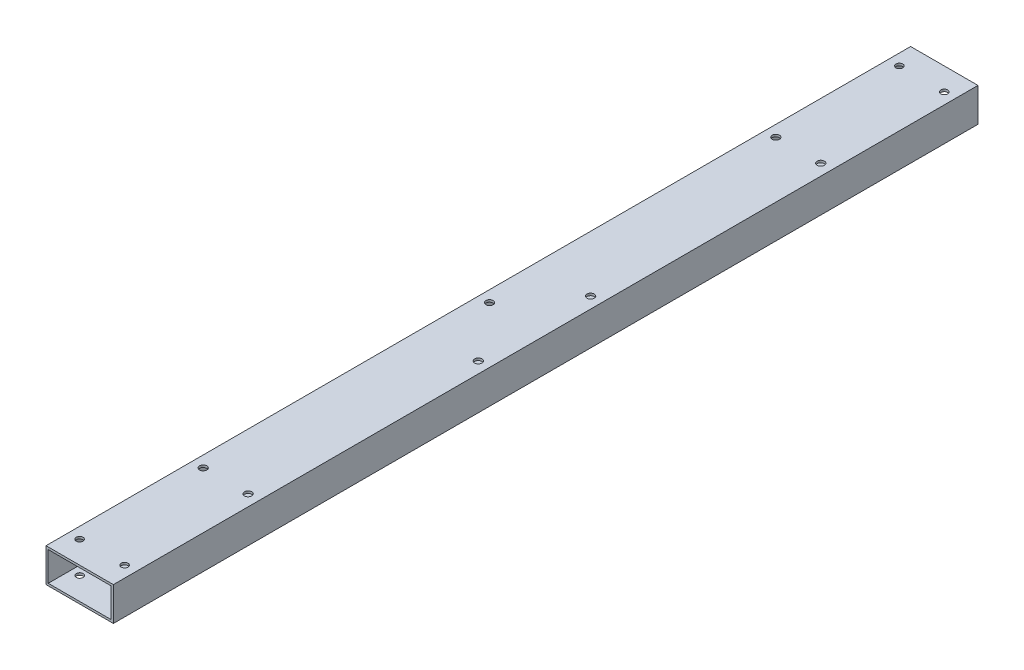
ISO-10303-21;
HEADER;
FILE_DESCRIPTION(('STEP AP214'),'2;1');
FILE_NAME('part.step','',(''),(''),'','','');
FILE_SCHEMA(('AUTOMOTIVE_DESIGN { 1 0 10303 214 1 1 1 1 }'));
ENDSEC;
DATA;
#1=APPLICATION_CONTEXT('core data for automotive mechanical design processes');
#2=APPLICATION_PROTOCOL_DEFINITION('international standard','automotive_design',2000,#1);
#3=PRODUCT_CONTEXT('',#1,'mechanical');
#4=PRODUCT('Part','Part','',(#3));
#5=PRODUCT_RELATED_PRODUCT_CATEGORY('part','',(#4));
#6=PRODUCT_DEFINITION_FORMATION('','',#4);
#7=PRODUCT_DEFINITION_CONTEXT('part definition',#1,'design');
#8=PRODUCT_DEFINITION('design','',#6,#7);
#9=PRODUCT_DEFINITION_SHAPE('','',#8);
#10=(LENGTH_UNIT() NAMED_UNIT(*) SI_UNIT(.MILLI.,.METRE.));
#11=(NAMED_UNIT(*) PLANE_ANGLE_UNIT() SI_UNIT($,.RADIAN.));
#12=(NAMED_UNIT(*) SI_UNIT($,.STERADIAN.) SOLID_ANGLE_UNIT());
#13=UNCERTAINTY_MEASURE_WITH_UNIT(LENGTH_MEASURE(1.E-05),#10,'distance_accuracy_value','');
#14=(GEOMETRIC_REPRESENTATION_CONTEXT(3) GLOBAL_UNCERTAINTY_ASSIGNED_CONTEXT((#13)) GLOBAL_UNIT_ASSIGNED_CONTEXT((#10,
#11,#12)) REPRESENTATION_CONTEXT('',''));
#15=CARTESIAN_POINT('',(0.,0.,0.));
#16=DIRECTION('',(0.,0.,1.));
#17=DIRECTION('',(1.,0.,0.));
#18=AXIS2_PLACEMENT_3D('',#15,#16,#17);
#19=CARTESIAN_POINT('',(0.,0.,385.));
#20=DIRECTION('',(0.,0.,1.));
#21=DIRECTION('',(1.,0.,0.));
#22=AXIS2_PLACEMENT_3D('',#19,#20,#21);
#23=PLANE('',#22);
#24=DIRECTION('',(0.,-1.,0.));
#25=VECTOR('',#24,1.);
#26=CARTESIAN_POINT('',(-30.,15.,385.));
#27=LINE('',#26,#25);
#28=CARTESIAN_POINT('',(-30.,15.,385.));
#29=VERTEX_POINT('',#28);
#30=CARTESIAN_POINT('',(-30.,-15.,385.));
#31=VERTEX_POINT('',#30);
#32=EDGE_CURVE('E197',#29,#31,#27,.T.);
#33=ORIENTED_EDGE('',*,*,#32,.T.);
#34=DIRECTION('',(1.,0.,0.));
#35=VECTOR('',#34,1.);
#36=CARTESIAN_POINT('',(-30.,-15.,385.));
#37=LINE('',#36,#35);
#38=CARTESIAN_POINT('',(30.,-15.,385.));
#39=VERTEX_POINT('',#38);
#40=EDGE_CURVE('E201',#31,#39,#37,.T.);
#41=ORIENTED_EDGE('',*,*,#40,.T.);
#42=DIRECTION('',(0.,1.,0.));
#43=VECTOR('',#42,1.);
#44=CARTESIAN_POINT('',(30.,15.,385.));
#45=LINE('',#44,#43);
#46=CARTESIAN_POINT('',(30.,15.,385.));
#47=VERTEX_POINT('',#46);
#48=EDGE_CURVE('E205',#39,#47,#45,.T.);
#49=ORIENTED_EDGE('',*,*,#48,.T.);
#50=DIRECTION('',(-1.,0.,0.));
#51=VECTOR('',#50,1.);
#52=CARTESIAN_POINT('',(-30.,15.,385.));
#53=LINE('',#52,#51);
#54=EDGE_CURVE('E208',#47,#29,#53,.T.);
#55=ORIENTED_EDGE('',*,*,#54,.T.);
#56=EDGE_LOOP('',(#33,#41,#49,#55));
#57=FACE_BOUND('',#56,.T.);
#58=DIRECTION('',(1.,0.,0.));
#59=VECTOR('',#58,1.);
#60=CARTESIAN_POINT('',(-28.,-13.,385.));
#61=LINE('',#60,#59);
#62=CARTESIAN_POINT('',(-28.,-13.,385.));
#63=VERTEX_POINT('',#62);
#64=CARTESIAN_POINT('',(28.,-13.,385.));
#65=VERTEX_POINT('',#64);
#66=EDGE_CURVE('E142',#63,#65,#61,.T.);
#67=ORIENTED_EDGE('',*,*,#66,.F.);
#68=DIRECTION('',(0.,-1.,0.));
#69=VECTOR('',#68,1.);
#70=CARTESIAN_POINT('',(-28.,13.,385.));
#71=LINE('',#70,#69);
#72=CARTESIAN_POINT('',(-28.,13.,385.));
#73=VERTEX_POINT('',#72);
#74=EDGE_CURVE('E132',#73,#63,#71,.T.);
#75=ORIENTED_EDGE('',*,*,#74,.F.);
#76=DIRECTION('',(-1.,0.,0.));
#77=VECTOR('',#76,1.);
#78=CARTESIAN_POINT('',(-28.,13.,385.));
#79=LINE('',#78,#77);
#80=CARTESIAN_POINT('',(28.,13.,385.));
#81=VERTEX_POINT('',#80);
#82=EDGE_CURVE('E162',#81,#73,#79,.T.);
#83=ORIENTED_EDGE('',*,*,#82,.F.);
#84=DIRECTION('',(0.,1.,0.));
#85=VECTOR('',#84,1.);
#86=CARTESIAN_POINT('',(28.,13.,385.));
#87=LINE('',#86,#85);
#88=EDGE_CURVE('E158',#65,#81,#87,.T.);
#89=ORIENTED_EDGE('',*,*,#88,.F.);
#90=EDGE_LOOP('',(#67,#75,#83,#89));
#91=FACE_BOUND('',#90,.T.);
#92=ADVANCED_FACE('F44',(#57,#91),#23,.T.);
#93=CARTESIAN_POINT('',(0.,0.,-385.));
#94=DIRECTION('',(0.,0.,1.));
#95=DIRECTION('',(1.,0.,0.));
#96=AXIS2_PLACEMENT_3D('',#93,#94,#95);
#97=PLANE('',#96);
#98=DIRECTION('',(0.,-1.,0.));
#99=VECTOR('',#98,1.);
#100=CARTESIAN_POINT('',(-30.,15.,-385.));
#101=LINE('',#100,#99);
#102=CARTESIAN_POINT('',(-30.,15.,-385.));
#103=VERTEX_POINT('',#102);
#104=CARTESIAN_POINT('',(-30.,-15.,-385.));
#105=VERTEX_POINT('',#104);
#106=EDGE_CURVE('E152',#103,#105,#101,.T.);
#107=ORIENTED_EDGE('',*,*,#106,.F.);
#108=DIRECTION('',(-1.,0.,0.));
#109=VECTOR('',#108,1.);
#110=CARTESIAN_POINT('',(-30.,15.,-385.));
#111=LINE('',#110,#109);
#112=CARTESIAN_POINT('',(30.,15.,-385.));
#113=VERTEX_POINT('',#112);
#114=EDGE_CURVE('E202',#113,#103,#111,.T.);
#115=ORIENTED_EDGE('',*,*,#114,.F.);
#116=DIRECTION('',(0.,1.,0.));
#117=VECTOR('',#116,1.);
#118=CARTESIAN_POINT('',(30.,15.,-385.));
#119=LINE('',#118,#117);
#120=CARTESIAN_POINT('',(30.,-15.,-385.));
#121=VERTEX_POINT('',#120);
#122=EDGE_CURVE('E218',#121,#113,#119,.T.);
#123=ORIENTED_EDGE('',*,*,#122,.F.);
#124=DIRECTION('',(1.,0.,0.));
#125=VECTOR('',#124,1.);
#126=CARTESIAN_POINT('',(-30.,-15.,-385.));
#127=LINE('',#126,#125);
#128=EDGE_CURVE('E215',#105,#121,#127,.T.);
#129=ORIENTED_EDGE('',*,*,#128,.F.);
#130=EDGE_LOOP('',(#107,#115,#123,#129));
#131=FACE_BOUND('',#130,.T.);
#132=DIRECTION('',(0.,-1.,0.));
#133=VECTOR('',#132,1.);
#134=CARTESIAN_POINT('',(-28.,13.,-385.));
#135=LINE('',#134,#133);
#136=CARTESIAN_POINT('',(-28.,13.,-385.));
#137=VERTEX_POINT('',#136);
#138=CARTESIAN_POINT('',(-28.,-13.,-385.));
#139=VERTEX_POINT('',#138);
#140=EDGE_CURVE('E168',#137,#139,#135,.T.);
#141=ORIENTED_EDGE('',*,*,#140,.T.);
#142=DIRECTION('',(1.,0.,0.));
#143=VECTOR('',#142,1.);
#144=CARTESIAN_POINT('',(-28.,-13.,-385.));
#145=LINE('',#144,#143);
#146=CARTESIAN_POINT('',(28.,-13.,-385.));
#147=VERTEX_POINT('',#146);
#148=EDGE_CURVE('E172',#139,#147,#145,.T.);
#149=ORIENTED_EDGE('',*,*,#148,.T.);
#150=DIRECTION('',(0.,1.,0.));
#151=VECTOR('',#150,1.);
#152=CARTESIAN_POINT('',(28.,13.,-385.));
#153=LINE('',#152,#151);
#154=CARTESIAN_POINT('',(28.,13.,-385.));
#155=VERTEX_POINT('',#154);
#156=EDGE_CURVE('E177',#147,#155,#153,.T.);
#157=ORIENTED_EDGE('',*,*,#156,.T.);
#158=DIRECTION('',(-1.,0.,0.));
#159=VECTOR('',#158,1.);
#160=CARTESIAN_POINT('',(-28.,13.,-385.));
#161=LINE('',#160,#159);
#162=EDGE_CURVE('E143',#155,#137,#161,.T.);
#163=ORIENTED_EDGE('',*,*,#162,.T.);
#164=EDGE_LOOP('',(#141,#149,#157,#163));
#165=FACE_BOUND('',#164,.T.);
#166=ADVANCED_FACE('F390',(#131,#165),#97,.F.);
#167=CARTESIAN_POINT('',(-30.,15.,385.));
#168=DIRECTION('',(1.,0.,0.));
#169=DIRECTION('',(0.,0.,-1.));
#170=AXIS2_PLACEMENT_3D('',#167,#168,#169);
#171=PLANE('',#170);
#172=ORIENTED_EDGE('',*,*,#106,.T.);
#173=DIRECTION('',(0.,0.,-1.));
#174=VECTOR('',#173,1.);
#175=CARTESIAN_POINT('',(-30.,-15.,385.));
#176=LINE('',#175,#174);
#177=EDGE_CURVE('E11',#31,#105,#176,.T.);
#178=ORIENTED_EDGE('',*,*,#177,.F.);
#179=ORIENTED_EDGE('',*,*,#32,.F.);
#180=DIRECTION('',(0.,0.,-1.));
#181=VECTOR('',#180,1.);
#182=CARTESIAN_POINT('',(-30.,15.,385.));
#183=LINE('',#182,#181);
#184=EDGE_CURVE('E211',#29,#103,#183,.T.);
#185=ORIENTED_EDGE('',*,*,#184,.T.);
#186=EDGE_LOOP('',(#172,#178,#179,#185));
#187=FACE_BOUND('',#186,.T.);
#188=ADVANCED_FACE('F46',(#187),#171,.F.);
#189=CARTESIAN_POINT('',(-30.,-15.,385.));
#190=DIRECTION('',(0.,1.,0.));
#191=DIRECTION('',(0.,0.,1.));
#192=AXIS2_PLACEMENT_3D('',#189,#190,#191);
#193=PLANE('',#192);
#194=CARTESIAN_POINT('',(20.0000000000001,-15.,50.));
#195=DIRECTION('',(0.,-1.,0.));
#196=DIRECTION('',(0.,0.,-1.));
#197=AXIS2_PLACEMENT_3D('',#194,#195,#196);
#198=CIRCLE('',#197,8.);
#199=CARTESIAN_POINT('',(20.0000000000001,-15.,42.));
#200=VERTEX_POINT('',#199);
#201=EDGE_CURVE('E418',#200,#200,#198,.T.);
#202=ORIENTED_EDGE('',*,*,#201,.F.);
#203=EDGE_LOOP('',(#202));
#204=FACE_BOUND('',#203,.T.);
#205=CARTESIAN_POINT('',(-20.,-15.,255.));
#206=DIRECTION('',(0.,-1.,0.));
#207=DIRECTION('',(0.,0.,-1.));
#208=AXIS2_PLACEMENT_3D('',#205,#206,#207);
#209=CIRCLE('',#208,8.00000000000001);
#210=CARTESIAN_POINT('',(-20.,-15.,247.));
#211=VERTEX_POINT('',#210);
#212=EDGE_CURVE('E422',#211,#211,#209,.T.);
#213=ORIENTED_EDGE('',*,*,#212,.F.);
#214=EDGE_LOOP('',(#213));
#215=FACE_BOUND('',#214,.T.);
#216=CARTESIAN_POINT('',(20.,-15.,255.));
#217=DIRECTION('',(0.,-1.,0.));
#218=DIRECTION('',(0.,0.,-1.));
#219=AXIS2_PLACEMENT_3D('',#216,#217,#218);
#220=CIRCLE('',#219,8.);
#221=CARTESIAN_POINT('',(20.,-15.,247.));
#222=VERTEX_POINT('',#221);
#223=EDGE_CURVE('E426',#222,#222,#220,.T.);
#224=ORIENTED_EDGE('',*,*,#223,.F.);
#225=EDGE_LOOP('',(#224));
#226=FACE_BOUND('',#225,.T.);
#227=CARTESIAN_POINT('',(20.,-15.,365.));
#228=DIRECTION('',(0.,-1.,0.));
#229=DIRECTION('',(0.,0.,-1.));
#230=AXIS2_PLACEMENT_3D('',#227,#228,#229);
#231=CIRCLE('',#230,3.05000000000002);
#232=CARTESIAN_POINT('',(20.,-15.,361.95));
#233=VERTEX_POINT('',#232);
#234=EDGE_CURVE('E430',#233,#233,#231,.T.);
#235=ORIENTED_EDGE('',*,*,#234,.F.);
#236=EDGE_LOOP('',(#235));
#237=FACE_BOUND('',#236,.T.);
#238=CARTESIAN_POINT('',(-20.,-15.,365.));
#239=DIRECTION('',(0.,-1.,0.));
#240=DIRECTION('',(0.,0.,-1.));
#241=AXIS2_PLACEMENT_3D('',#238,#239,#240);
#242=CIRCLE('',#241,3.05000000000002);
#243=CARTESIAN_POINT('',(-20.,-15.,361.95));
#244=VERTEX_POINT('',#243);
#245=EDGE_CURVE('E270',#244,#244,#242,.T.);
#246=ORIENTED_EDGE('',*,*,#245,.F.);
#247=EDGE_LOOP('',(#246));
#248=FACE_BOUND('',#247,.T.);
#249=CARTESIAN_POINT('',(-20.,-15.,0.));
#250=DIRECTION('',(0.,1.,0.));
#251=DIRECTION('',(0.,0.,1.));
#252=AXIS2_PLACEMENT_3D('',#249,#250,#251);
#253=CIRCLE('',#252,8.);
#254=CARTESIAN_POINT('',(-20.,-15.,8.));
#255=VERTEX_POINT('',#254);
#256=EDGE_CURVE('E305',#255,#255,#253,.T.);
#257=ORIENTED_EDGE('',*,*,#256,.T.);
#258=EDGE_LOOP('',(#257));
#259=FACE_BOUND('',#258,.T.);
#260=CARTESIAN_POINT('',(20.0000000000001,-15.,-50.));
#261=DIRECTION('',(0.,1.,0.));
#262=DIRECTION('',(0.,0.,1.));
#263=AXIS2_PLACEMENT_3D('',#260,#261,#262);
#264=CIRCLE('',#263,8.);
#265=CARTESIAN_POINT('',(20.0000000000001,-15.,-42.));
#266=VERTEX_POINT('',#265);
#267=EDGE_CURVE('E311',#266,#266,#264,.T.);
#268=ORIENTED_EDGE('',*,*,#267,.T.);
#269=EDGE_LOOP('',(#268));
#270=FACE_BOUND('',#269,.T.);
#271=CARTESIAN_POINT('',(-20.,-15.,-255.));
#272=DIRECTION('',(0.,1.,0.));
#273=DIRECTION('',(0.,0.,1.));
#274=AXIS2_PLACEMENT_3D('',#271,#272,#273);
#275=CIRCLE('',#274,8.00000000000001);
#276=CARTESIAN_POINT('',(-20.,-15.,-247.));
#277=VERTEX_POINT('',#276);
#278=EDGE_CURVE('E306',#277,#277,#275,.T.);
#279=ORIENTED_EDGE('',*,*,#278,.T.);
#280=EDGE_LOOP('',(#279));
#281=FACE_BOUND('',#280,.T.);
#282=CARTESIAN_POINT('',(20.,-15.,-255.));
#283=DIRECTION('',(0.,1.,0.));
#284=DIRECTION('',(0.,0.,1.));
#285=AXIS2_PLACEMENT_3D('',#282,#283,#284);
#286=CIRCLE('',#285,8.);
#287=CARTESIAN_POINT('',(20.,-15.,-247.));
#288=VERTEX_POINT('',#287);
#289=EDGE_CURVE('E310',#288,#288,#286,.T.);
#290=ORIENTED_EDGE('',*,*,#289,.T.);
#291=EDGE_LOOP('',(#290));
#292=FACE_BOUND('',#291,.T.);
#293=CARTESIAN_POINT('',(20.,-15.,-365.));
#294=DIRECTION('',(0.,1.,0.));
#295=DIRECTION('',(0.,0.,1.));
#296=AXIS2_PLACEMENT_3D('',#293,#294,#295);
#297=CIRCLE('',#296,3.05000000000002);
#298=CARTESIAN_POINT('',(20.,-15.,-361.95));
#299=VERTEX_POINT('',#298);
#300=EDGE_CURVE('E337',#299,#299,#297,.T.);
#301=ORIENTED_EDGE('',*,*,#300,.T.);
#302=EDGE_LOOP('',(#301));
#303=FACE_BOUND('',#302,.T.);
#304=CARTESIAN_POINT('',(-20.,-15.,-365.));
#305=DIRECTION('',(0.,1.,0.));
#306=DIRECTION('',(0.,0.,1.));
#307=AXIS2_PLACEMENT_3D('',#304,#305,#306);
#308=CIRCLE('',#307,3.05000000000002);
#309=CARTESIAN_POINT('',(-20.,-15.,-361.95));
#310=VERTEX_POINT('',#309);
#311=EDGE_CURVE('E238',#310,#310,#308,.T.);
#312=ORIENTED_EDGE('',*,*,#311,.T.);
#313=EDGE_LOOP('',(#312));
#314=FACE_BOUND('',#313,.T.);
#315=ORIENTED_EDGE('',*,*,#128,.T.);
#316=DIRECTION('',(0.,0.,-1.));
#317=VECTOR('',#316,1.);
#318=CARTESIAN_POINT('',(30.,-15.,385.));
#319=LINE('',#318,#317);
#320=EDGE_CURVE('E54',#39,#121,#319,.T.);
#321=ORIENTED_EDGE('',*,*,#320,.F.);
#322=ORIENTED_EDGE('',*,*,#40,.F.);
#323=ORIENTED_EDGE('',*,*,#177,.T.);
#324=EDGE_LOOP('',(#315,#321,#322,#323));
#325=FACE_BOUND('',#324,.T.);
#326=ADVANCED_FACE('F406',(#204,#215,#226,#237,#248,#259,#270,#281,#292,#303,#314,#325),#193,.F.);
#327=CARTESIAN_POINT('',(30.,15.,385.));
#328=DIRECTION('',(-1.,0.,0.));
#329=DIRECTION('',(0.,0.,1.));
#330=AXIS2_PLACEMENT_3D('',#327,#328,#329);
#331=PLANE('',#330);
#332=ORIENTED_EDGE('',*,*,#122,.T.);
#333=DIRECTION('',(0.,0.,-1.));
#334=VECTOR('',#333,1.);
#335=CARTESIAN_POINT('',(30.,15.,385.));
#336=LINE('',#335,#334);
#337=EDGE_CURVE('E226',#47,#113,#336,.T.);
#338=ORIENTED_EDGE('',*,*,#337,.F.);
#339=ORIENTED_EDGE('',*,*,#48,.F.);
#340=ORIENTED_EDGE('',*,*,#320,.T.);
#341=EDGE_LOOP('',(#332,#338,#339,#340));
#342=FACE_BOUND('',#341,.T.);
#343=ADVANCED_FACE('F403',(#342),#331,.F.);
#344=CARTESIAN_POINT('',(-30.,15.,385.));
#345=DIRECTION('',(0.,-1.,0.));
#346=DIRECTION('',(0.,0.,-1.));
#347=AXIS2_PLACEMENT_3D('',#344,#345,#346);
#348=PLANE('',#347);
#349=CARTESIAN_POINT('',(20.,15.,255.));
#350=DIRECTION('',(0.,-1.,0.));
#351=DIRECTION('',(0.,0.,-1.));
#352=AXIS2_PLACEMENT_3D('',#349,#350,#351);
#353=CIRCLE('',#352,3.25);
#354=CARTESIAN_POINT('',(20.,15.,251.75));
#355=VERTEX_POINT('',#354);
#356=EDGE_CURVE('E301',#355,#355,#353,.F.);
#357=ORIENTED_EDGE('',*,*,#356,.F.);
#358=EDGE_LOOP('',(#357));
#359=FACE_BOUND('',#358,.T.);
#360=CARTESIAN_POINT('',(-20.,15.,255.));
#361=DIRECTION('',(0.,-1.,0.));
#362=DIRECTION('',(0.,0.,-1.));
#363=AXIS2_PLACEMENT_3D('',#360,#361,#362);
#364=CIRCLE('',#363,3.25);
#365=CARTESIAN_POINT('',(-20.,15.,251.75));
#366=VERTEX_POINT('',#365);
#367=EDGE_CURVE('E284',#366,#366,#364,.F.);
#368=ORIENTED_EDGE('',*,*,#367,.F.);
#369=EDGE_LOOP('',(#368));
#370=FACE_BOUND('',#369,.T.);
#371=CARTESIAN_POINT('',(20.,15.,365.));
#372=DIRECTION('',(0.,-1.,0.));
#373=DIRECTION('',(0.,0.,-1.));
#374=AXIS2_PLACEMENT_3D('',#371,#372,#373);
#375=CIRCLE('',#374,3.05000000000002);
#376=CARTESIAN_POINT('',(20.,15.,361.95));
#377=VERTEX_POINT('',#376);
#378=EDGE_CURVE('E285',#377,#377,#375,.F.);
#379=ORIENTED_EDGE('',*,*,#378,.F.);
#380=EDGE_LOOP('',(#379));
#381=FACE_BOUND('',#380,.T.);
#382=CARTESIAN_POINT('',(20.0000000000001,15.,50.));
#383=DIRECTION('',(0.,-1.,0.));
#384=DIRECTION('',(0.,0.,-1.));
#385=AXIS2_PLACEMENT_3D('',#382,#383,#384);
#386=CIRCLE('',#385,3.25);
#387=CARTESIAN_POINT('',(20.0000000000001,15.,46.75));
#388=VERTEX_POINT('',#387);
#389=EDGE_CURVE('E275',#388,#388,#386,.F.);
#390=ORIENTED_EDGE('',*,*,#389,.F.);
#391=EDGE_LOOP('',(#390));
#392=FACE_BOUND('',#391,.T.);
#393=CARTESIAN_POINT('',(-20.,15.,365.));
#394=DIRECTION('',(0.,-1.,0.));
#395=DIRECTION('',(0.,0.,-1.));
#396=AXIS2_PLACEMENT_3D('',#393,#394,#395);
#397=CIRCLE('',#396,3.05000000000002);
#398=CARTESIAN_POINT('',(-20.,15.,361.95));
#399=VERTEX_POINT('',#398);
#400=EDGE_CURVE('E276',#399,#399,#397,.F.);
#401=ORIENTED_EDGE('',*,*,#400,.F.);
#402=EDGE_LOOP('',(#401));
#403=FACE_BOUND('',#402,.T.);
#404=CARTESIAN_POINT('',(-20.,15.,0.));
#405=DIRECTION('',(0.,-1.,0.));
#406=DIRECTION('',(0.,0.,-1.));
#407=AXIS2_PLACEMENT_3D('',#404,#405,#406);
#408=CIRCLE('',#407,3.25);
#409=CARTESIAN_POINT('',(-20.,15.,-3.25));
#410=VERTEX_POINT('',#409);
#411=EDGE_CURVE('E173',#410,#410,#408,.T.);
#412=ORIENTED_EDGE('',*,*,#411,.T.);
#413=EDGE_LOOP('',(#412));
#414=FACE_BOUND('',#413,.T.);
#415=CARTESIAN_POINT('',(20.,15.,-255.));
#416=DIRECTION('',(0.,-1.,0.));
#417=DIRECTION('',(0.,0.,-1.));
#418=AXIS2_PLACEMENT_3D('',#415,#416,#417);
#419=CIRCLE('',#418,3.25);
#420=CARTESIAN_POINT('',(20.,15.,-258.25));
#421=VERTEX_POINT('',#420);
#422=EDGE_CURVE('E260',#421,#421,#419,.T.);
#423=ORIENTED_EDGE('',*,*,#422,.T.);
#424=EDGE_LOOP('',(#423));
#425=FACE_BOUND('',#424,.T.);
#426=CARTESIAN_POINT('',(-20.,15.,-255.));
#427=DIRECTION('',(0.,-1.,0.));
#428=DIRECTION('',(0.,0.,-1.));
#429=AXIS2_PLACEMENT_3D('',#426,#427,#428);
#430=CIRCLE('',#429,3.25);
#431=CARTESIAN_POINT('',(-20.,15.,-258.25));
#432=VERTEX_POINT('',#431);
#433=EDGE_CURVE('E254',#432,#432,#430,.T.);
#434=ORIENTED_EDGE('',*,*,#433,.T.);
#435=EDGE_LOOP('',(#434));
#436=FACE_BOUND('',#435,.T.);
#437=CARTESIAN_POINT('',(20.,15.,-365.));
#438=DIRECTION('',(0.,-1.,0.));
#439=DIRECTION('',(0.,0.,-1.));
#440=AXIS2_PLACEMENT_3D('',#437,#438,#439);
#441=CIRCLE('',#440,3.05000000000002);
#442=CARTESIAN_POINT('',(20.,15.,-368.05));
#443=VERTEX_POINT('',#442);
#444=EDGE_CURVE('E255',#443,#443,#441,.T.);
#445=ORIENTED_EDGE('',*,*,#444,.T.);
#446=EDGE_LOOP('',(#445));
#447=FACE_BOUND('',#446,.T.);
#448=CARTESIAN_POINT('',(20.0000000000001,15.,-50.));
#449=DIRECTION('',(0.,-1.,0.));
#450=DIRECTION('',(0.,0.,-1.));
#451=AXIS2_PLACEMENT_3D('',#448,#449,#450);
#452=CIRCLE('',#451,3.25);
#453=CARTESIAN_POINT('',(20.0000000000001,15.,-53.25));
#454=VERTEX_POINT('',#453);
#455=EDGE_CURVE('E243',#454,#454,#452,.T.);
#456=ORIENTED_EDGE('',*,*,#455,.T.);
#457=EDGE_LOOP('',(#456));
#458=FACE_BOUND('',#457,.T.);
#459=CARTESIAN_POINT('',(-20.,15.,-365.));
#460=DIRECTION('',(0.,-1.,0.));
#461=DIRECTION('',(0.,0.,-1.));
#462=AXIS2_PLACEMENT_3D('',#459,#460,#461);
#463=CIRCLE('',#462,3.05000000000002);
#464=CARTESIAN_POINT('',(-20.,15.,-368.05));
#465=VERTEX_POINT('',#464);
#466=EDGE_CURVE('E244',#465,#465,#463,.T.);
#467=ORIENTED_EDGE('',*,*,#466,.T.);
#468=EDGE_LOOP('',(#467));
#469=FACE_BOUND('',#468,.T.);
#470=ORIENTED_EDGE('',*,*,#114,.T.);
#471=ORIENTED_EDGE('',*,*,#184,.F.);
#472=ORIENTED_EDGE('',*,*,#54,.F.);
#473=ORIENTED_EDGE('',*,*,#337,.T.);
#474=EDGE_LOOP('',(#470,#471,#472,#473));
#475=FACE_BOUND('',#474,.T.);
#476=ADVANCED_FACE('F368',(#359,#370,#381,#392,#403,#414,#425,#436,#447,#458,#469,#475),#348,.F.);
#477=CARTESIAN_POINT('',(-28.,13.,385.));
#478=DIRECTION('',(1.,0.,0.));
#479=DIRECTION('',(0.,1.,0.));
#480=AXIS2_PLACEMENT_3D('',#477,#478,#479);
#481=PLANE('',#480);
#482=DIRECTION('',(0.,0.,-1.));
#483=VECTOR('',#482,1.);
#484=CARTESIAN_POINT('',(-28.,-13.,385.));
#485=LINE('',#484,#483);
#486=CARTESIAN_POINT('',(-28.,-13.,255.));
#487=VERTEX_POINT('',#486);
#488=EDGE_CURVE('E135',#63,#487,#485,.T.);
#489=ORIENTED_EDGE('',*,*,#488,.T.);
#490=CARTESIAN_POINT('',(-28.,-13.,0.));
#491=VERTEX_POINT('',#490);
#492=EDGE_CURVE('E153',#487,#491,#485,.T.);
#493=ORIENTED_EDGE('',*,*,#492,.T.);
#494=CARTESIAN_POINT('',(-28.,-13.,-255.));
#495=VERTEX_POINT('',#494);
#496=EDGE_CURVE('E155',#491,#495,#485,.T.);
#497=ORIENTED_EDGE('',*,*,#496,.T.);
#498=EDGE_CURVE('E192',#495,#139,#485,.T.);
#499=ORIENTED_EDGE('',*,*,#498,.T.);
#500=ORIENTED_EDGE('',*,*,#140,.F.);
#501=DIRECTION('',(0.,0.,-1.));
#502=VECTOR('',#501,1.);
#503=CARTESIAN_POINT('',(-28.,13.,385.));
#504=LINE('',#503,#502);
#505=EDGE_CURVE('E137',#73,#137,#504,.T.);
#506=ORIENTED_EDGE('',*,*,#505,.F.);
#507=ORIENTED_EDGE('',*,*,#74,.T.);
#508=EDGE_LOOP('',(#489,#493,#497,#499,#500,#506,#507));
#509=FACE_BOUND('',#508,.T.);
#510=ADVANCED_FACE('F134',(#509),#481,.T.);
#511=CARTESIAN_POINT('',(-28.,-13.,385.));
#512=DIRECTION('',(0.,1.,0.));
#513=DIRECTION('',(0.,0.,1.));
#514=AXIS2_PLACEMENT_3D('',#511,#512,#513);
#515=PLANE('',#514);
#516=CARTESIAN_POINT('',(20.,-13.,365.));
#517=DIRECTION('',(0.,1.,0.));
#518=DIRECTION('',(0.,0.,1.));
#519=AXIS2_PLACEMENT_3D('',#516,#517,#518);
#520=CIRCLE('',#519,3.05000000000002);
#521=CARTESIAN_POINT('',(20.,-13.,368.05));
#522=VERTEX_POINT('',#521);
#523=EDGE_CURVE('E280',#522,#522,#520,.F.);
#524=ORIENTED_EDGE('',*,*,#523,.T.);
#525=EDGE_LOOP('',(#524));
#526=FACE_BOUND('',#525,.T.);
#527=CARTESIAN_POINT('',(-20.,-13.,365.));
#528=DIRECTION('',(0.,1.,0.));
#529=DIRECTION('',(0.,0.,1.));
#530=AXIS2_PLACEMENT_3D('',#527,#528,#529);
#531=CIRCLE('',#530,3.05000000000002);
#532=CARTESIAN_POINT('',(-20.,-13.,368.05));
#533=VERTEX_POINT('',#532);
#534=EDGE_CURVE('E269',#533,#533,#531,.F.);
#535=ORIENTED_EDGE('',*,*,#534,.T.);
#536=EDGE_LOOP('',(#535));
#537=FACE_BOUND('',#536,.T.);
#538=CARTESIAN_POINT('',(20.,-13.,-365.));
#539=DIRECTION('',(0.,1.,0.));
#540=DIRECTION('',(0.,0.,1.));
#541=AXIS2_PLACEMENT_3D('',#538,#539,#540);
#542=CIRCLE('',#541,3.05000000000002);
#543=CARTESIAN_POINT('',(20.,-13.,-361.95));
#544=VERTEX_POINT('',#543);
#545=EDGE_CURVE('E249',#544,#544,#542,.T.);
#546=ORIENTED_EDGE('',*,*,#545,.F.);
#547=EDGE_LOOP('',(#546));
#548=FACE_BOUND('',#547,.T.);
#549=CARTESIAN_POINT('',(-20.,-13.,-365.));
#550=DIRECTION('',(0.,1.,0.));
#551=DIRECTION('',(0.,0.,1.));
#552=AXIS2_PLACEMENT_3D('',#549,#550,#551);
#553=CIRCLE('',#552,3.05000000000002);
#554=CARTESIAN_POINT('',(-20.,-13.,-361.95));
#555=VERTEX_POINT('',#554);
#556=EDGE_CURVE('E237',#555,#555,#553,.T.);
#557=ORIENTED_EDGE('',*,*,#556,.F.);
#558=EDGE_LOOP('',(#557));
#559=FACE_BOUND('',#558,.T.);
#560=DIRECTION('',(0.,0.,-1.));
#561=VECTOR('',#560,1.);
#562=CARTESIAN_POINT('',(28.,-13.,385.));
#563=LINE('',#562,#561);
#564=CARTESIAN_POINT('',(28.,-13.,255.));
#565=VERTEX_POINT('',#564);
#566=CARTESIAN_POINT('',(28.,-13.,50.));
#567=VERTEX_POINT('',#566);
#568=EDGE_CURVE('E193',#565,#567,#563,.T.);
#569=ORIENTED_EDGE('',*,*,#568,.T.);
#570=CARTESIAN_POINT('',(20.0000000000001,-13.,50.));
#571=DIRECTION('',(0.,1.,0.));
#572=DIRECTION('',(0.,0.,1.));
#573=AXIS2_PLACEMENT_3D('',#570,#571,#572);
#574=CIRCLE('',#573,8.);
#575=EDGE_CURVE('E65',#567,#567,#574,.T.);
#576=ORIENTED_EDGE('',*,*,#575,.F.);
#577=CARTESIAN_POINT('',(28.,-13.,-50.));
#578=VERTEX_POINT('',#577);
#579=EDGE_CURVE('E194',#567,#578,#563,.T.);
#580=ORIENTED_EDGE('',*,*,#579,.T.);
#581=CARTESIAN_POINT('',(20.0000000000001,-13.,-50.));
#582=DIRECTION('',(0.,1.,0.));
#583=DIRECTION('',(0.,0.,1.));
#584=AXIS2_PLACEMENT_3D('',#581,#582,#583);
#585=CIRCLE('',#584,8.);
#586=EDGE_CURVE('E329',#578,#578,#585,.F.);
#587=ORIENTED_EDGE('',*,*,#586,.T.);
#588=CARTESIAN_POINT('',(28.,-13.,-255.));
#589=VERTEX_POINT('',#588);
#590=EDGE_CURVE('E195',#578,#589,#563,.T.);
#591=ORIENTED_EDGE('',*,*,#590,.T.);
#592=CARTESIAN_POINT('',(20.,-13.,-255.));
#593=DIRECTION('',(0.,1.,0.));
#594=DIRECTION('',(0.,0.,1.));
#595=AXIS2_PLACEMENT_3D('',#592,#593,#594);
#596=CIRCLE('',#595,8.);
#597=EDGE_CURVE('E321',#589,#589,#596,.F.);
#598=ORIENTED_EDGE('',*,*,#597,.T.);
#599=EDGE_CURVE('E189',#589,#147,#563,.T.);
#600=ORIENTED_EDGE('',*,*,#599,.T.);
#601=ORIENTED_EDGE('',*,*,#148,.F.);
#602=ORIENTED_EDGE('',*,*,#498,.F.);
#603=CARTESIAN_POINT('',(-20.,-13.,-255.));
#604=DIRECTION('',(0.,1.,0.));
#605=DIRECTION('',(0.,0.,1.));
#606=AXIS2_PLACEMENT_3D('',#603,#604,#605);
#607=CIRCLE('',#606,8.00000000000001);
#608=EDGE_CURVE('E325',#495,#495,#607,.F.);
#609=ORIENTED_EDGE('',*,*,#608,.T.);
#610=ORIENTED_EDGE('',*,*,#496,.F.);
#611=CARTESIAN_POINT('',(-20.,-13.,0.));
#612=DIRECTION('',(0.,1.,0.));
#613=DIRECTION('',(0.,0.,1.));
#614=AXIS2_PLACEMENT_3D('',#611,#612,#613);
#615=CIRCLE('',#614,8.);
#616=EDGE_CURVE('E333',#491,#491,#615,.F.);
#617=ORIENTED_EDGE('',*,*,#616,.T.);
#618=ORIENTED_EDGE('',*,*,#492,.F.);
#619=CARTESIAN_POINT('',(-20.,-13.,255.));
#620=DIRECTION('',(0.,1.,0.));
#621=DIRECTION('',(0.,0.,1.));
#622=AXIS2_PLACEMENT_3D('',#619,#620,#621);
#623=CIRCLE('',#622,8.00000000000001);
#624=EDGE_CURVE('E60',#487,#487,#623,.T.);
#625=ORIENTED_EDGE('',*,*,#624,.F.);
#626=ORIENTED_EDGE('',*,*,#488,.F.);
#627=ORIENTED_EDGE('',*,*,#66,.T.);
#628=EDGE_CURVE('E190',#65,#565,#563,.T.);
#629=ORIENTED_EDGE('',*,*,#628,.T.);
#630=CARTESIAN_POINT('',(20.,-13.,255.));
#631=DIRECTION('',(0.,1.,0.));
#632=DIRECTION('',(0.,0.,1.));
#633=AXIS2_PLACEMENT_3D('',#630,#631,#632);
#634=CIRCLE('',#633,8.);
#635=EDGE_CURVE('E516',#565,#565,#634,.T.);
#636=ORIENTED_EDGE('',*,*,#635,.F.);
#637=EDGE_LOOP('',(#569,#576,#580,#587,#591,#598,#600,#601,#602,#609,#610,#617,#618,#625,#626,
#627,#629,#636));
#638=FACE_BOUND('',#637,.T.);
#639=ADVANCED_FACE('F147',(#526,#537,#548,#559,#638),#515,.T.);
#640=CARTESIAN_POINT('',(28.,13.,385.));
#641=DIRECTION('',(-1.,0.,0.));
#642=DIRECTION('',(0.,0.,1.));
#643=AXIS2_PLACEMENT_3D('',#640,#641,#642);
#644=PLANE('',#643);
#645=ORIENTED_EDGE('',*,*,#579,.F.);
#646=ORIENTED_EDGE('',*,*,#568,.F.);
#647=ORIENTED_EDGE('',*,*,#628,.F.);
#648=ORIENTED_EDGE('',*,*,#88,.T.);
#649=DIRECTION('',(0.,0.,-1.));
#650=VECTOR('',#649,1.);
#651=CARTESIAN_POINT('',(28.,13.,385.));
#652=LINE('',#651,#650);
#653=EDGE_CURVE('E186',#81,#155,#652,.T.);
#654=ORIENTED_EDGE('',*,*,#653,.T.);
#655=ORIENTED_EDGE('',*,*,#156,.F.);
#656=ORIENTED_EDGE('',*,*,#599,.F.);
#657=ORIENTED_EDGE('',*,*,#590,.F.);
#658=EDGE_LOOP('',(#645,#646,#647,#648,#654,#655,#656,#657));
#659=FACE_BOUND('',#658,.T.);
#660=ADVANCED_FACE('F471',(#659),#644,.T.);
#661=CARTESIAN_POINT('',(-28.,13.,385.));
#662=DIRECTION('',(0.,-1.,0.));
#663=DIRECTION('',(0.,0.,-1.));
#664=AXIS2_PLACEMENT_3D('',#661,#662,#663);
#665=PLANE('',#664);
#666=CARTESIAN_POINT('',(20.,13.,365.));
#667=DIRECTION('',(0.,-1.,0.));
#668=DIRECTION('',(0.,0.,-1.));
#669=AXIS2_PLACEMENT_3D('',#666,#667,#668);
#670=CIRCLE('',#669,3.05000000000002);
#671=CARTESIAN_POINT('',(20.,13.,361.95));
#672=VERTEX_POINT('',#671);
#673=EDGE_CURVE('E277',#672,#672,#670,.F.);
#674=ORIENTED_EDGE('',*,*,#673,.T.);
#675=EDGE_LOOP('',(#674));
#676=FACE_BOUND('',#675,.T.);
#677=CARTESIAN_POINT('',(-20.,13.,365.));
#678=DIRECTION('',(0.,-1.,0.));
#679=DIRECTION('',(0.,0.,-1.));
#680=AXIS2_PLACEMENT_3D('',#677,#678,#679);
#681=CIRCLE('',#680,3.05000000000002);
#682=CARTESIAN_POINT('',(-20.,13.,361.95));
#683=VERTEX_POINT('',#682);
#684=EDGE_CURVE('E265',#683,#683,#681,.F.);
#685=ORIENTED_EDGE('',*,*,#684,.T.);
#686=EDGE_LOOP('',(#685));
#687=FACE_BOUND('',#686,.T.);
#688=CARTESIAN_POINT('',(20.,13.,-365.));
#689=DIRECTION('',(0.,-1.,0.));
#690=DIRECTION('',(0.,0.,-1.));
#691=AXIS2_PLACEMENT_3D('',#688,#689,#690);
#692=CIRCLE('',#691,3.05000000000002);
#693=CARTESIAN_POINT('',(20.,13.,-368.05));
#694=VERTEX_POINT('',#693);
#695=EDGE_CURVE('E245',#694,#694,#692,.T.);
#696=ORIENTED_EDGE('',*,*,#695,.F.);
#697=EDGE_LOOP('',(#696));
#698=FACE_BOUND('',#697,.T.);
#699=CARTESIAN_POINT('',(-20.,13.,-365.));
#700=DIRECTION('',(0.,-1.,0.));
#701=DIRECTION('',(0.,0.,-1.));
#702=AXIS2_PLACEMENT_3D('',#699,#700,#701);
#703=CIRCLE('',#702,3.05000000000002);
#704=CARTESIAN_POINT('',(-20.,13.,-368.05));
#705=VERTEX_POINT('',#704);
#706=EDGE_CURVE('E233',#705,#705,#703,.T.);
#707=ORIENTED_EDGE('',*,*,#706,.F.);
#708=EDGE_LOOP('',(#707));
#709=FACE_BOUND('',#708,.T.);
#710=ORIENTED_EDGE('',*,*,#505,.T.);
#711=ORIENTED_EDGE('',*,*,#162,.F.);
#712=ORIENTED_EDGE('',*,*,#653,.F.);
#713=ORIENTED_EDGE('',*,*,#82,.T.);
#714=EDGE_LOOP('',(#710,#711,#712,#713));
#715=FACE_BOUND('',#714,.T.);
#716=CARTESIAN_POINT('',(20.,13.,-255.));
#717=DIRECTION('',(0.,-1.,0.));
#718=DIRECTION('',(0.,0.,-1.));
#719=AXIS2_PLACEMENT_3D('',#716,#717,#718);
#720=CIRCLE('',#719,3.25);
#721=CARTESIAN_POINT('',(20.,13.,-258.25));
#722=VERTEX_POINT('',#721);
#723=EDGE_CURVE('E256',#722,#722,#720,.T.);
#724=ORIENTED_EDGE('',*,*,#723,.F.);
#725=EDGE_LOOP('',(#724));
#726=FACE_BOUND('',#725,.T.);
#727=CARTESIAN_POINT('',(-20.,13.,-255.));
#728=DIRECTION('',(0.,-1.,0.));
#729=DIRECTION('',(0.,0.,-1.));
#730=AXIS2_PLACEMENT_3D('',#727,#728,#729);
#731=CIRCLE('',#730,3.25);
#732=CARTESIAN_POINT('',(-20.,13.,-258.25));
#733=VERTEX_POINT('',#732);
#734=EDGE_CURVE('E250',#733,#733,#731,.T.);
#735=ORIENTED_EDGE('',*,*,#734,.F.);
#736=EDGE_LOOP('',(#735));
#737=FACE_BOUND('',#736,.T.);
#738=CARTESIAN_POINT('',(20.0000000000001,13.,-50.));
#739=DIRECTION('',(0.,-1.,0.));
#740=DIRECTION('',(0.,0.,-1.));
#741=AXIS2_PLACEMENT_3D('',#738,#739,#740);
#742=CIRCLE('',#741,3.25);
#743=CARTESIAN_POINT('',(20.0000000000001,13.,-53.25));
#744=VERTEX_POINT('',#743);
#745=EDGE_CURVE('E239',#744,#744,#742,.T.);
#746=ORIENTED_EDGE('',*,*,#745,.F.);
#747=EDGE_LOOP('',(#746));
#748=FACE_BOUND('',#747,.T.);
#749=CARTESIAN_POINT('',(20.,13.,255.));
#750=DIRECTION('',(0.,-1.,0.));
#751=DIRECTION('',(0.,0.,-1.));
#752=AXIS2_PLACEMENT_3D('',#749,#750,#751);
#753=CIRCLE('',#752,3.25);
#754=CARTESIAN_POINT('',(20.,13.,251.75));
#755=VERTEX_POINT('',#754);
#756=EDGE_CURVE('E48',#755,#755,#753,.F.);
#757=ORIENTED_EDGE('',*,*,#756,.T.);
#758=EDGE_LOOP('',(#757));
#759=FACE_BOUND('',#758,.T.);
#760=CARTESIAN_POINT('',(-20.,13.,255.));
#761=DIRECTION('',(0.,-1.,0.));
#762=DIRECTION('',(0.,0.,-1.));
#763=AXIS2_PLACEMENT_3D('',#760,#761,#762);
#764=CIRCLE('',#763,3.25);
#765=CARTESIAN_POINT('',(-20.,13.,251.75));
#766=VERTEX_POINT('',#765);
#767=EDGE_CURVE('E281',#766,#766,#764,.F.);
#768=ORIENTED_EDGE('',*,*,#767,.T.);
#769=EDGE_LOOP('',(#768));
#770=FACE_BOUND('',#769,.T.);
#771=CARTESIAN_POINT('',(20.0000000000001,13.,50.));
#772=DIRECTION('',(0.,-1.,0.));
#773=DIRECTION('',(0.,0.,-1.));
#774=AXIS2_PLACEMENT_3D('',#771,#772,#773);
#775=CIRCLE('',#774,3.25);
#776=CARTESIAN_POINT('',(20.0000000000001,13.,46.75));
#777=VERTEX_POINT('',#776);
#778=EDGE_CURVE('E271',#777,#777,#775,.F.);
#779=ORIENTED_EDGE('',*,*,#778,.T.);
#780=EDGE_LOOP('',(#779));
#781=FACE_BOUND('',#780,.T.);
#782=CARTESIAN_POINT('',(-20.,13.,0.));
#783=DIRECTION('',(0.,-1.,0.));
#784=DIRECTION('',(0.,0.,-1.));
#785=AXIS2_PLACEMENT_3D('',#782,#783,#784);
#786=CIRCLE('',#785,3.25);
#787=CARTESIAN_POINT('',(-20.,13.,-3.25));
#788=VERTEX_POINT('',#787);
#789=EDGE_CURVE('E261',#788,#788,#786,.T.);
#790=ORIENTED_EDGE('',*,*,#789,.F.);
#791=EDGE_LOOP('',(#790));
#792=FACE_BOUND('',#791,.T.);
#793=ADVANCED_FACE('F473',(#676,#687,#698,#709,#715,#726,#737,#748,#759,#770,#781,#792),#665,.T.);
#794=CARTESIAN_POINT('',(-20.,-15.,-365.));
#795=DIRECTION('',(0.,1.,0.));
#796=DIRECTION('',(0.,0.,1.));
#797=AXIS2_PLACEMENT_3D('',#794,#795,#796);
#798=CYLINDRICAL_SURFACE('',#797,3.05000000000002);
#799=ORIENTED_EDGE('',*,*,#706,.T.);
#800=EDGE_LOOP('',(#799));
#801=FACE_BOUND('',#800,.T.);
#802=ORIENTED_EDGE('',*,*,#466,.F.);
#803=EDGE_LOOP('',(#802));
#804=FACE_BOUND('',#803,.T.);
#805=ADVANCED_FACE('F384',(#801,#804),#798,.F.);
#806=CARTESIAN_POINT('',(20.0000000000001,-15.,-50.));
#807=DIRECTION('',(0.,1.,0.));
#808=DIRECTION('',(0.,0.,1.));
#809=AXIS2_PLACEMENT_3D('',#806,#807,#808);
#810=CYLINDRICAL_SURFACE('',#809,3.25);
#811=ORIENTED_EDGE('',*,*,#745,.T.);
#812=EDGE_LOOP('',(#811));
#813=FACE_BOUND('',#812,.T.);
#814=ORIENTED_EDGE('',*,*,#455,.F.);
#815=EDGE_LOOP('',(#814));
#816=FACE_BOUND('',#815,.T.);
#817=ADVANCED_FACE('F569',(#813,#816),#810,.F.);
#818=CARTESIAN_POINT('',(20.,-15.,-365.));
#819=DIRECTION('',(0.,1.,0.));
#820=DIRECTION('',(0.,0.,1.));
#821=AXIS2_PLACEMENT_3D('',#818,#819,#820);
#822=CYLINDRICAL_SURFACE('',#821,3.05000000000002);
#823=ORIENTED_EDGE('',*,*,#695,.T.);
#824=EDGE_LOOP('',(#823));
#825=FACE_BOUND('',#824,.T.);
#826=ORIENTED_EDGE('',*,*,#444,.F.);
#827=EDGE_LOOP('',(#826));
#828=FACE_BOUND('',#827,.T.);
#829=ADVANCED_FACE('F571',(#825,#828),#822,.F.);
#830=CARTESIAN_POINT('',(-20.,-15.,-255.));
#831=DIRECTION('',(0.,1.,0.));
#832=DIRECTION('',(0.,0.,1.));
#833=AXIS2_PLACEMENT_3D('',#830,#831,#832);
#834=CYLINDRICAL_SURFACE('',#833,3.25);
#835=ORIENTED_EDGE('',*,*,#734,.T.);
#836=EDGE_LOOP('',(#835));
#837=FACE_BOUND('',#836,.T.);
#838=ORIENTED_EDGE('',*,*,#433,.F.);
#839=EDGE_LOOP('',(#838));
#840=FACE_BOUND('',#839,.T.);
#841=ADVANCED_FACE('F385',(#837,#840),#834,.F.);
#842=CARTESIAN_POINT('',(20.,-15.,-255.));
#843=DIRECTION('',(0.,1.,0.));
#844=DIRECTION('',(0.,0.,1.));
#845=AXIS2_PLACEMENT_3D('',#842,#843,#844);
#846=CYLINDRICAL_SURFACE('',#845,3.25);
#847=ORIENTED_EDGE('',*,*,#723,.T.);
#848=EDGE_LOOP('',(#847));
#849=FACE_BOUND('',#848,.T.);
#850=ORIENTED_EDGE('',*,*,#422,.F.);
#851=EDGE_LOOP('',(#850));
#852=FACE_BOUND('',#851,.T.);
#853=ADVANCED_FACE('F374',(#849,#852),#846,.F.);
#854=CARTESIAN_POINT('',(-20.,-15.,0.));
#855=DIRECTION('',(0.,1.,0.));
#856=DIRECTION('',(0.,0.,1.));
#857=AXIS2_PLACEMENT_3D('',#854,#855,#856);
#858=CYLINDRICAL_SURFACE('',#857,3.25);
#859=ORIENTED_EDGE('',*,*,#789,.T.);
#860=EDGE_LOOP('',(#859));
#861=FACE_BOUND('',#860,.T.);
#862=ORIENTED_EDGE('',*,*,#411,.F.);
#863=EDGE_LOOP('',(#862));
#864=FACE_BOUND('',#863,.T.);
#865=ADVANCED_FACE('F371',(#861,#864),#858,.F.);
#866=ORIENTED_EDGE('',*,*,#556,.T.);
#867=EDGE_LOOP('',(#866));
#868=FACE_BOUND('',#867,.T.);
#869=ORIENTED_EDGE('',*,*,#311,.F.);
#870=EDGE_LOOP('',(#869));
#871=FACE_BOUND('',#870,.T.);
#872=ADVANCED_FACE('F373',(#868,#871),#798,.F.);
#873=ORIENTED_EDGE('',*,*,#545,.T.);
#874=EDGE_LOOP('',(#873));
#875=FACE_BOUND('',#874,.T.);
#876=ORIENTED_EDGE('',*,*,#300,.F.);
#877=EDGE_LOOP('',(#876));
#878=FACE_BOUND('',#877,.T.);
#879=ADVANCED_FACE('F381',(#875,#878),#822,.F.);
#880=CARTESIAN_POINT('',(20.,35.6274169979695,-255.));
#881=DIRECTION('',(0.,-1.,0.));
#882=DIRECTION('',(0.,0.,-1.));
#883=AXIS2_PLACEMENT_3D('',#880,#881,#882);
#884=CYLINDRICAL_SURFACE('',#883,8.);
#885=ORIENTED_EDGE('',*,*,#597,.F.);
#886=EDGE_LOOP('',(#885));
#887=FACE_BOUND('',#886,.T.);
#888=ORIENTED_EDGE('',*,*,#289,.F.);
#889=EDGE_LOOP('',(#888));
#890=FACE_BOUND('',#889,.T.);
#891=ADVANCED_FACE('F559',(#887,#890),#884,.F.);
#892=CARTESIAN_POINT('',(-20.,35.6274169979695,-255.));
#893=DIRECTION('',(0.,-1.,0.));
#894=DIRECTION('',(0.,0.,-1.));
#895=AXIS2_PLACEMENT_3D('',#892,#893,#894);
#896=CYLINDRICAL_SURFACE('',#895,8.00000000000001);
#897=ORIENTED_EDGE('',*,*,#608,.F.);
#898=EDGE_LOOP('',(#897));
#899=FACE_BOUND('',#898,.T.);
#900=ORIENTED_EDGE('',*,*,#278,.F.);
#901=EDGE_LOOP('',(#900));
#902=FACE_BOUND('',#901,.T.);
#903=ADVANCED_FACE('F555',(#899,#902),#896,.F.);
#904=CARTESIAN_POINT('',(20.0000000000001,35.6274169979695,-50.));
#905=DIRECTION('',(0.,-1.,0.));
#906=DIRECTION('',(0.,0.,-1.));
#907=AXIS2_PLACEMENT_3D('',#904,#905,#906);
#908=CYLINDRICAL_SURFACE('',#907,8.);
#909=ORIENTED_EDGE('',*,*,#586,.F.);
#910=EDGE_LOOP('',(#909));
#911=FACE_BOUND('',#910,.T.);
#912=ORIENTED_EDGE('',*,*,#267,.F.);
#913=EDGE_LOOP('',(#912));
#914=FACE_BOUND('',#913,.T.);
#915=ADVANCED_FACE('F558',(#911,#914),#908,.F.);
#916=CARTESIAN_POINT('',(-20.,35.6274169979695,0.));
#917=DIRECTION('',(0.,-1.,0.));
#918=DIRECTION('',(0.,0.,-1.));
#919=AXIS2_PLACEMENT_3D('',#916,#917,#918);
#920=CYLINDRICAL_SURFACE('',#919,8.);
#921=ORIENTED_EDGE('',*,*,#616,.F.);
#922=EDGE_LOOP('',(#921));
#923=FACE_BOUND('',#922,.T.);
#924=ORIENTED_EDGE('',*,*,#256,.F.);
#925=EDGE_LOOP('',(#924));
#926=FACE_BOUND('',#925,.T.);
#927=ADVANCED_FACE('F553',(#923,#926),#920,.F.);
#928=CARTESIAN_POINT('',(-20.,-15.,365.));
#929=DIRECTION('',(0.,1.,0.));
#930=DIRECTION('',(0.,0.,1.));
#931=AXIS2_PLACEMENT_3D('',#928,#929,#930);
#932=CYLINDRICAL_SURFACE('',#931,3.05000000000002);
#933=ORIENTED_EDGE('',*,*,#684,.F.);
#934=EDGE_LOOP('',(#933));
#935=FACE_BOUND('',#934,.T.);
#936=ORIENTED_EDGE('',*,*,#400,.T.);
#937=EDGE_LOOP('',(#936));
#938=FACE_BOUND('',#937,.T.);
#939=ADVANCED_FACE('F495',(#935,#938),#932,.F.);
#940=CARTESIAN_POINT('',(20.0000000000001,-15.,50.));
#941=DIRECTION('',(0.,1.,0.));
#942=DIRECTION('',(0.,0.,1.));
#943=AXIS2_PLACEMENT_3D('',#940,#941,#942);
#944=CYLINDRICAL_SURFACE('',#943,3.25);
#945=ORIENTED_EDGE('',*,*,#778,.F.);
#946=EDGE_LOOP('',(#945));
#947=FACE_BOUND('',#946,.T.);
#948=ORIENTED_EDGE('',*,*,#389,.T.);
#949=EDGE_LOOP('',(#948));
#950=FACE_BOUND('',#949,.T.);
#951=ADVANCED_FACE('F491',(#947,#950),#944,.F.);
#952=CARTESIAN_POINT('',(20.,-15.,365.));
#953=DIRECTION('',(0.,1.,0.));
#954=DIRECTION('',(0.,0.,1.));
#955=AXIS2_PLACEMENT_3D('',#952,#953,#954);
#956=CYLINDRICAL_SURFACE('',#955,3.05000000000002);
#957=ORIENTED_EDGE('',*,*,#673,.F.);
#958=EDGE_LOOP('',(#957));
#959=FACE_BOUND('',#958,.T.);
#960=ORIENTED_EDGE('',*,*,#378,.T.);
#961=EDGE_LOOP('',(#960));
#962=FACE_BOUND('',#961,.T.);
#963=ADVANCED_FACE('F494',(#959,#962),#956,.F.);
#964=CARTESIAN_POINT('',(-20.,-15.,255.));
#965=DIRECTION('',(0.,1.,0.));
#966=DIRECTION('',(0.,0.,1.));
#967=AXIS2_PLACEMENT_3D('',#964,#965,#966);
#968=CYLINDRICAL_SURFACE('',#967,3.25);
#969=ORIENTED_EDGE('',*,*,#767,.F.);
#970=EDGE_LOOP('',(#969));
#971=FACE_BOUND('',#970,.T.);
#972=ORIENTED_EDGE('',*,*,#367,.T.);
#973=EDGE_LOOP('',(#972));
#974=FACE_BOUND('',#973,.T.);
#975=ADVANCED_FACE('F543',(#971,#974),#968,.F.);
#976=CARTESIAN_POINT('',(20.,-15.,255.));
#977=DIRECTION('',(0.,1.,0.));
#978=DIRECTION('',(0.,0.,1.));
#979=AXIS2_PLACEMENT_3D('',#976,#977,#978);
#980=CYLINDRICAL_SURFACE('',#979,3.25);
#981=ORIENTED_EDGE('',*,*,#756,.F.);
#982=EDGE_LOOP('',(#981));
#983=FACE_BOUND('',#982,.T.);
#984=ORIENTED_EDGE('',*,*,#356,.T.);
#985=EDGE_LOOP('',(#984));
#986=FACE_BOUND('',#985,.T.);
#987=ADVANCED_FACE('F539',(#983,#986),#980,.F.);
#988=ORIENTED_EDGE('',*,*,#534,.F.);
#989=EDGE_LOOP('',(#988));
#990=FACE_BOUND('',#989,.T.);
#991=ORIENTED_EDGE('',*,*,#245,.T.);
#992=EDGE_LOOP('',(#991));
#993=FACE_BOUND('',#992,.T.);
#994=ADVANCED_FACE('F542',(#990,#993),#932,.F.);
#995=ORIENTED_EDGE('',*,*,#523,.F.);
#996=EDGE_LOOP('',(#995));
#997=FACE_BOUND('',#996,.T.);
#998=ORIENTED_EDGE('',*,*,#234,.T.);
#999=EDGE_LOOP('',(#998));
#1000=FACE_BOUND('',#999,.T.);
#1001=ADVANCED_FACE('F535',(#997,#1000),#956,.F.);
#1002=CARTESIAN_POINT('',(20.,35.6274169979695,255.));
#1003=DIRECTION('',(0.,-1.,0.));
#1004=DIRECTION('',(0.,0.,-1.));
#1005=AXIS2_PLACEMENT_3D('',#1002,#1003,#1004);
#1006=CYLINDRICAL_SURFACE('',#1005,8.);
#1007=ORIENTED_EDGE('',*,*,#635,.T.);
#1008=EDGE_LOOP('',(#1007));
#1009=FACE_BOUND('',#1008,.T.);
#1010=ORIENTED_EDGE('',*,*,#223,.T.);
#1011=EDGE_LOOP('',(#1010));
#1012=FACE_BOUND('',#1011,.T.);
#1013=ADVANCED_FACE('F528',(#1009,#1012),#1006,.F.);
#1014=CARTESIAN_POINT('',(-20.,35.6274169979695,255.));
#1015=DIRECTION('',(0.,-1.,0.));
#1016=DIRECTION('',(0.,0.,-1.));
#1017=AXIS2_PLACEMENT_3D('',#1014,#1015,#1016);
#1018=CYLINDRICAL_SURFACE('',#1017,8.00000000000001);
#1019=ORIENTED_EDGE('',*,*,#624,.T.);
#1020=EDGE_LOOP('',(#1019));
#1021=FACE_BOUND('',#1020,.T.);
#1022=ORIENTED_EDGE('',*,*,#212,.T.);
#1023=EDGE_LOOP('',(#1022));
#1024=FACE_BOUND('',#1023,.T.);
#1025=ADVANCED_FACE('F525',(#1021,#1024),#1018,.F.);
#1026=CARTESIAN_POINT('',(20.0000000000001,35.6274169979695,50.));
#1027=DIRECTION('',(0.,-1.,0.));
#1028=DIRECTION('',(0.,0.,-1.));
#1029=AXIS2_PLACEMENT_3D('',#1026,#1027,#1028);
#1030=CYLINDRICAL_SURFACE('',#1029,8.);
#1031=ORIENTED_EDGE('',*,*,#575,.T.);
#1032=EDGE_LOOP('',(#1031));
#1033=FACE_BOUND('',#1032,.T.);
#1034=ORIENTED_EDGE('',*,*,#201,.T.);
#1035=EDGE_LOOP('',(#1034));
#1036=FACE_BOUND('',#1035,.T.);
#1037=ADVANCED_FACE('F527',(#1033,#1036),#1030,.F.);
#1038=CLOSED_SHELL('',(#92,#166,#188,#326,#343,#476,#510,#639,#660,#793,#805,#817,#829,#841,
#853,#865,#872,#879,#891,#903,#915,#927,#939,#951,#963,#975,#987,#994,#1001,#1013,#1025,#1037));
#1039=MANIFOLD_SOLID_BREP('B2',#1038);
#1040=ADVANCED_BREP_SHAPE_REPRESENTATION('',(#18,#1039),#14);
#1041=SHAPE_DEFINITION_REPRESENTATION(#9,#1040);
ENDSEC;
END-ISO-10303-21;
